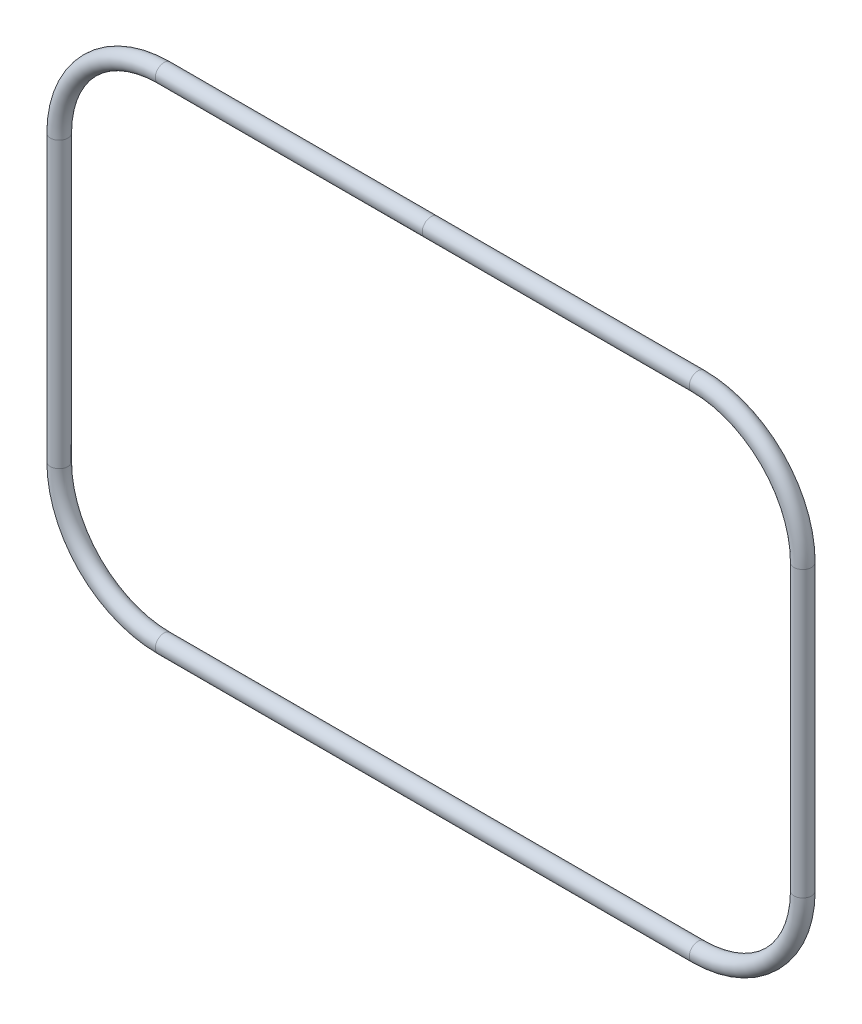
from build123d import *

# Parameters (mm, degrees)
SKETCH2_R = 0.889


with BuildPart() as part:
    # Sweep1: sweep along a path in Sketch1
    with BuildLine(Plane.XY) as sweep1_path:
        Line((-27.178, -24.892), (27.178, -24.892))
        ThreePointArc((27.178, -24.892), (34.541810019, -21.841810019), (37.592, -14.478))
        Line((37.592, -14.478), (37.592, 14.478))
        ThreePointArc((37.592, 14.478), (34.541810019, 21.841810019), (27.178, 24.892))
        Line((27.178, 24.892), (-27.178, 24.892))
        ThreePointArc((-27.178, 24.892), (-34.541810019, 21.841810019), (-37.592, 14.478))
        Line((-37.592, 14.478), (-37.592, -14.478))
        ThreePointArc((-37.592, -14.478), (-34.541810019, -21.841810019), (-27.178, -24.892))
    # Sketch2 → Sweep1 (sweep)
    with BuildSketch(Plane(origin=(0, 0, 0), x_dir=(0, 0, -1), z_dir=(1, 0, 0))):
        with Locations((0, 25.146)):
            Circle(SKETCH2_R)
    sweep(path=sweep1_path.line)


solid = part.part
